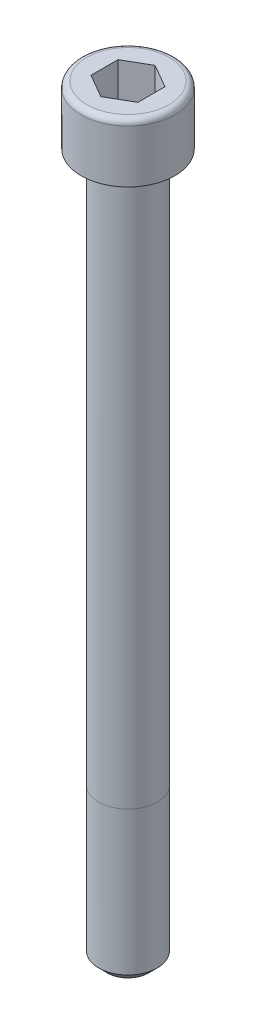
ISO-10303-21;
HEADER;
FILE_DESCRIPTION(('STEP AP214'),'2;1');
FILE_NAME('part.step','',(''),(''),'','','');
FILE_SCHEMA(('AUTOMOTIVE_DESIGN { 1 0 10303 214 1 1 1 1 }'));
ENDSEC;
DATA;
#1=APPLICATION_CONTEXT('core data for automotive mechanical design processes');
#2=APPLICATION_PROTOCOL_DEFINITION('international standard','automotive_design',2000,#1);
#3=PRODUCT_CONTEXT('',#1,'mechanical');
#4=PRODUCT('Part','Part','',(#3));
#5=PRODUCT_RELATED_PRODUCT_CATEGORY('part','',(#4));
#6=PRODUCT_DEFINITION_FORMATION('','',#4);
#7=PRODUCT_DEFINITION_CONTEXT('part definition',#1,'design');
#8=PRODUCT_DEFINITION('design','',#6,#7);
#9=PRODUCT_DEFINITION_SHAPE('','',#8);
#10=(LENGTH_UNIT() NAMED_UNIT(*) SI_UNIT(.MILLI.,.METRE.));
#11=(NAMED_UNIT(*) PLANE_ANGLE_UNIT() SI_UNIT($,.RADIAN.));
#12=(NAMED_UNIT(*) SI_UNIT($,.STERADIAN.) SOLID_ANGLE_UNIT());
#13=UNCERTAINTY_MEASURE_WITH_UNIT(LENGTH_MEASURE(1.E-05),#10,'distance_accuracy_value','');
#14=(GEOMETRIC_REPRESENTATION_CONTEXT(3) GLOBAL_UNCERTAINTY_ASSIGNED_CONTEXT((#13)) GLOBAL_UNIT_ASSIGNED_CONTEXT((#10,
#11,#12)) REPRESENTATION_CONTEXT('',''));
#15=CARTESIAN_POINT('',(0.,0.,0.));
#16=DIRECTION('',(0.,0.,1.));
#17=DIRECTION('',(1.,0.,0.));
#18=AXIS2_PLACEMENT_3D('',#15,#16,#17);
#19=CARTESIAN_POINT('',(0.,65.1172922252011,0.));
#20=DIRECTION('',(0.,1.,0.));
#21=DIRECTION('',(-1.,0.,0.));
#22=AXIS2_PLACEMENT_3D('',#19,#20,#21);
#23=CYLINDRICAL_SURFACE('',#22,4.99999999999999);
#24=CARTESIAN_POINT('',(0.,-128.5,0.));
#25=DIRECTION('',(0.,1.,0.));
#26=DIRECTION('',(-1.,0.,0.));
#27=AXIS2_PLACEMENT_3D('',#24,#25,#26);
#28=CIRCLE('',#27,5.);
#29=CARTESIAN_POINT('',(-4.99999999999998,-128.5,0.));
#30=VERTEX_POINT('',#29);
#31=EDGE_CURVE('E569',#30,#30,#28,.T.);
#32=ORIENTED_EDGE('',*,*,#31,.T.);
#33=EDGE_LOOP('',(#32));
#34=FACE_BOUND('',#33,.T.);
#35=CARTESIAN_POINT('',(0.,-104.,0.));
#36=DIRECTION('',(0.,1.,0.));
#37=DIRECTION('',(0.,0.,1.));
#38=AXIS2_PLACEMENT_3D('',#35,#36,#37);
#39=CIRCLE('',#38,4.99999999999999);
#40=CARTESIAN_POINT('',(0.,-104.,4.99999999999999));
#41=VERTEX_POINT('',#40);
#42=EDGE_CURVE('E11',#41,#41,#39,.T.);
#43=ORIENTED_EDGE('',*,*,#42,.F.);
#44=EDGE_LOOP('',(#43));
#45=FACE_BOUND('',#44,.T.);
#46=ADVANCED_FACE('F450',(#34,#45),#23,.T.);
#47=CARTESIAN_POINT('',(3.50000000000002,-130.,0.));
#48=DIRECTION('',(0.,-1.,0.));
#49=DIRECTION('',(1.,0.,0.));
#50=AXIS2_PLACEMENT_3D('',#47,#48,#49);
#51=PLANE('',#50);
#52=CARTESIAN_POINT('',(0.,-130.,0.));
#53=DIRECTION('',(0.,1.,0.));
#54=DIRECTION('',(-1.,0.,0.));
#55=AXIS2_PLACEMENT_3D('',#52,#53,#54);
#56=CIRCLE('',#55,3.5);
#57=CARTESIAN_POINT('',(-3.49999999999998,-130.,0.));
#58=VERTEX_POINT('',#57);
#59=EDGE_CURVE('E459',#58,#58,#56,.T.);
#60=ORIENTED_EDGE('',*,*,#59,.F.);
#61=EDGE_LOOP('',(#60));
#62=FACE_BOUND('',#61,.T.);
#63=ADVANCED_FACE('F452',(#62),#51,.T.);
#64=CARTESIAN_POINT('',(0.,-130.,0.));
#65=DIRECTION('',(0.,1.,0.));
#66=DIRECTION('',(-1.,0.,0.));
#67=AXIS2_PLACEMENT_3D('',#64,#65,#66);
#68=CONICAL_SURFACE('',#67,3.5,0.785398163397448);
#69=ORIENTED_EDGE('',*,*,#31,.F.);
#70=EDGE_LOOP('',(#69));
#71=FACE_BOUND('',#70,.T.);
#72=ORIENTED_EDGE('',*,*,#59,.T.);
#73=EDGE_LOOP('',(#72));
#74=FACE_BOUND('',#73,.T.);
#75=ADVANCED_FACE('F574',(#71,#74),#68,.T.);
#76=ORIENTED_EDGE('',*,*,#42,.T.);
#77=EDGE_LOOP('',(#76));
#78=FACE_BOUND('',#77,.T.);
#79=CARTESIAN_POINT('',(0.,-9.99999999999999,0.));
#80=DIRECTION('',(0.,1.,0.));
#81=DIRECTION('',(-1.,0.,0.));
#82=AXIS2_PLACEMENT_3D('',#79,#80,#81);
#83=CIRCLE('',#82,4.99999999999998);
#84=CARTESIAN_POINT('',(-4.99999999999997,-9.99999999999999,0.));
#85=VERTEX_POINT('',#84);
#86=EDGE_CURVE('E566',#85,#85,#83,.T.);
#87=ORIENTED_EDGE('',*,*,#86,.F.);
#88=EDGE_LOOP('',(#87));
#89=FACE_BOUND('',#88,.T.);
#90=ADVANCED_FACE('F580',(#78,#89),#23,.T.);
#91=CARTESIAN_POINT('',(4.99999999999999,-10.,0.));
#92=DIRECTION('',(0.,1.,0.));
#93=DIRECTION('',(-1.,0.,0.));
#94=AXIS2_PLACEMENT_3D('',#91,#92,#93);
#95=PLANE('',#94);
#96=CARTESIAN_POINT('',(0.,-9.99999999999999,0.));
#97=DIRECTION('',(0.,1.,0.));
#98=DIRECTION('',(-1.,0.,0.));
#99=AXIS2_PLACEMENT_3D('',#96,#97,#98);
#100=CIRCLE('',#99,7.99999999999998);
#101=CARTESIAN_POINT('',(-7.99999999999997,-10.,0.));
#102=VERTEX_POINT('',#101);
#103=EDGE_CURVE('E563',#102,#102,#100,.T.);
#104=ORIENTED_EDGE('',*,*,#103,.F.);
#105=EDGE_LOOP('',(#104));
#106=FACE_BOUND('',#105,.T.);
#107=ORIENTED_EDGE('',*,*,#86,.T.);
#108=EDGE_LOOP('',(#107));
#109=FACE_BOUND('',#108,.T.);
#110=ADVANCED_FACE('F591',(#106,#109),#95,.F.);
#111=CARTESIAN_POINT('',(0.,65.1172922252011,0.));
#112=DIRECTION('',(0.,1.,0.));
#113=DIRECTION('',(-1.,0.,0.));
#114=AXIS2_PLACEMENT_3D('',#111,#112,#113);
#115=CYLINDRICAL_SURFACE('',#114,7.99999999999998);
#116=CARTESIAN_POINT('',(0.,-1.,0.));
#117=DIRECTION('',(0.,1.,0.));
#118=DIRECTION('',(-1.,0.,0.));
#119=AXIS2_PLACEMENT_3D('',#116,#117,#118);
#120=CIRCLE('',#119,7.99999999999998);
#121=CARTESIAN_POINT('',(-7.99999999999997,-1.,0.));
#122=VERTEX_POINT('',#121);
#123=EDGE_CURVE('E560',#122,#122,#120,.T.);
#124=ORIENTED_EDGE('',*,*,#123,.F.);
#125=EDGE_LOOP('',(#124));
#126=FACE_BOUND('',#125,.T.);
#127=ORIENTED_EDGE('',*,*,#103,.T.);
#128=EDGE_LOOP('',(#127));
#129=FACE_BOUND('',#128,.T.);
#130=ADVANCED_FACE('F596',(#126,#129),#115,.T.);
#131=CARTESIAN_POINT('',(0.,-1.,0.));
#132=DIRECTION('',(0.,1.,0.));
#133=DIRECTION('',(-1.,0.,0.));
#134=AXIS2_PLACEMENT_3D('',#131,#132,#133);
#135=TOROIDAL_SURFACE('',#134,6.99999999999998,1.);
#136=CARTESIAN_POINT('',(0.,0.,0.));
#137=DIRECTION('',(0.,1.,0.));
#138=DIRECTION('',(-1.,0.,0.));
#139=AXIS2_PLACEMENT_3D('',#136,#137,#138);
#140=CIRCLE('',#139,6.99999999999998);
#141=CARTESIAN_POINT('',(-6.99999999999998,0.,0.));
#142=VERTEX_POINT('',#141);
#143=EDGE_CURVE('E551',#142,#142,#140,.T.);
#144=ORIENTED_EDGE('',*,*,#143,.F.);
#145=EDGE_LOOP('',(#144));
#146=FACE_BOUND('',#145,.T.);
#147=ORIENTED_EDGE('',*,*,#123,.T.);
#148=EDGE_LOOP('',(#147));
#149=FACE_BOUND('',#148,.T.);
#150=ADVANCED_FACE('F605',(#146,#149),#135,.T.);
#151=CARTESIAN_POINT('',(6.99999999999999,0.,0.));
#152=DIRECTION('',(0.,-1.,0.));
#153=DIRECTION('',(1.,0.,0.));
#154=AXIS2_PLACEMENT_3D('',#151,#152,#153);
#155=PLANE('',#154);
#156=DIRECTION('',(0.,0.,1.));
#157=VECTOR('',#156,1.);
#158=CARTESIAN_POINT('',(-4.,0.,-2.3094010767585));
#159=LINE('',#158,#157);
#160=CARTESIAN_POINT('',(-4.,0.,-2.3094010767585));
#161=VERTEX_POINT('',#160);
#162=CARTESIAN_POINT('',(-4.,0.,2.3094010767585));
#163=VERTEX_POINT('',#162);
#164=EDGE_CURVE('E520',#161,#163,#159,.T.);
#165=ORIENTED_EDGE('',*,*,#164,.F.);
#166=DIRECTION('',(-0.866025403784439,0.,0.5));
#167=VECTOR('',#166,1.);
#168=CARTESIAN_POINT('',(0.,0.,-4.61880215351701));
#169=LINE('',#168,#167);
#170=CARTESIAN_POINT('',(0.,0.,-4.61880215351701));
#171=VERTEX_POINT('',#170);
#172=EDGE_CURVE('E466',#171,#161,#169,.T.);
#173=ORIENTED_EDGE('',*,*,#172,.F.);
#174=DIRECTION('',(0.866025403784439,0.,0.5));
#175=VECTOR('',#174,1.);
#176=CARTESIAN_POINT('',(0.,0.,-4.61880215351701));
#177=LINE('',#176,#175);
#178=CARTESIAN_POINT('',(4.,0.,-2.3094010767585));
#179=VERTEX_POINT('',#178);
#180=EDGE_CURVE('E535',#171,#179,#177,.T.);
#181=ORIENTED_EDGE('',*,*,#180,.T.);
#182=DIRECTION('',(0.,0.,1.));
#183=VECTOR('',#182,1.);
#184=CARTESIAN_POINT('',(4.,0.,-2.3094010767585));
#185=LINE('',#184,#183);
#186=CARTESIAN_POINT('',(4.,0.,2.3094010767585));
#187=VERTEX_POINT('',#186);
#188=EDGE_CURVE('E530',#179,#187,#185,.T.);
#189=ORIENTED_EDGE('',*,*,#188,.T.);
#190=DIRECTION('',(-0.866025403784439,0.,0.5));
#191=VECTOR('',#190,1.);
#192=CARTESIAN_POINT('',(4.,0.,2.3094010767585));
#193=LINE('',#192,#191);
#194=CARTESIAN_POINT('',(0.,0.,4.61880215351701));
#195=VERTEX_POINT('',#194);
#196=EDGE_CURVE('E528',#187,#195,#193,.T.);
#197=ORIENTED_EDGE('',*,*,#196,.T.);
#198=DIRECTION('',(0.866025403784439,0.,0.5));
#199=VECTOR('',#198,1.);
#200=CARTESIAN_POINT('',(-4.,0.,2.3094010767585));
#201=LINE('',#200,#199);
#202=EDGE_CURVE('E509',#163,#195,#201,.T.);
#203=ORIENTED_EDGE('',*,*,#202,.F.);
#204=EDGE_LOOP('',(#165,#173,#181,#189,#197,#203));
#205=FACE_BOUND('',#204,.T.);
#206=ORIENTED_EDGE('',*,*,#143,.T.);
#207=EDGE_LOOP('',(#206));
#208=FACE_BOUND('',#207,.T.);
#209=ADVANCED_FACE('F524',(#205,#208),#155,.F.);
#210=CARTESIAN_POINT('',(0.,-7.2,-4.61880215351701));
#211=DIRECTION('',(-0.5,0.,-0.866025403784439));
#212=DIRECTION('',(-0.866025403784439,0.,0.5));
#213=AXIS2_PLACEMENT_3D('',#210,#211,#212);
#214=PLANE('',#213);
#215=ORIENTED_EDGE('',*,*,#172,.T.);
#216=DIRECTION('',(0.,1.,0.));
#217=VECTOR('',#216,1.);
#218=CARTESIAN_POINT('',(-4.,-7.2,-2.3094010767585));
#219=LINE('',#218,#217);
#220=CARTESIAN_POINT('',(-4.,-7.2,-2.3094010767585));
#221=VERTEX_POINT('',#220);
#222=EDGE_CURVE('E517',#221,#161,#219,.T.);
#223=ORIENTED_EDGE('',*,*,#222,.F.);
#224=DIRECTION('',(-0.866025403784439,0.,0.5));
#225=VECTOR('',#224,1.);
#226=CARTESIAN_POINT('',(0.,-7.2,-4.61880215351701));
#227=LINE('',#226,#225);
#228=CARTESIAN_POINT('',(0.,-7.2,-4.61880215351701));
#229=VERTEX_POINT('',#228);
#230=EDGE_CURVE('E538',#229,#221,#227,.T.);
#231=ORIENTED_EDGE('',*,*,#230,.F.);
#232=DIRECTION('',(0.,1.,0.));
#233=VECTOR('',#232,1.);
#234=CARTESIAN_POINT('',(0.,-7.2,-4.61880215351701));
#235=LINE('',#234,#233);
#236=EDGE_CURVE('E473',#229,#171,#235,.T.);
#237=ORIENTED_EDGE('',*,*,#236,.T.);
#238=EDGE_LOOP('',(#215,#223,#231,#237));
#239=FACE_BOUND('',#238,.T.);
#240=ADVANCED_FACE('F615',(#239),#214,.F.);
#241=CARTESIAN_POINT('',(0.,-7.2,-4.61880215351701));
#242=DIRECTION('',(-0.5,0.,0.866025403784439));
#243=DIRECTION('',(0.866025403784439,0.,0.5));
#244=AXIS2_PLACEMENT_3D('',#241,#242,#243);
#245=PLANE('',#244);
#246=ORIENTED_EDGE('',*,*,#180,.F.);
#247=ORIENTED_EDGE('',*,*,#236,.F.);
#248=DIRECTION('',(0.866025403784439,0.,0.5));
#249=VECTOR('',#248,1.);
#250=CARTESIAN_POINT('',(0.,-7.2,-4.61880215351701));
#251=LINE('',#250,#249);
#252=CARTESIAN_POINT('',(4.,-7.2,-2.3094010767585));
#253=VERTEX_POINT('',#252);
#254=EDGE_CURVE('E548',#229,#253,#251,.T.);
#255=ORIENTED_EDGE('',*,*,#254,.T.);
#256=DIRECTION('',(0.,1.,0.));
#257=VECTOR('',#256,1.);
#258=CARTESIAN_POINT('',(4.,-7.2,-2.3094010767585));
#259=LINE('',#258,#257);
#260=EDGE_CURVE('E552',#253,#179,#259,.T.);
#261=ORIENTED_EDGE('',*,*,#260,.T.);
#262=EDGE_LOOP('',(#246,#247,#255,#261));
#263=FACE_BOUND('',#262,.T.);
#264=ADVANCED_FACE('F618',(#263),#245,.T.);
#265=CARTESIAN_POINT('',(4.,-7.2,-2.3094010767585));
#266=DIRECTION('',(-1.,0.,0.));
#267=DIRECTION('',(0.,-1.,0.));
#268=AXIS2_PLACEMENT_3D('',#265,#266,#267);
#269=PLANE('',#268);
#270=ORIENTED_EDGE('',*,*,#188,.F.);
#271=ORIENTED_EDGE('',*,*,#260,.F.);
#272=DIRECTION('',(0.,0.,1.));
#273=VECTOR('',#272,1.);
#274=CARTESIAN_POINT('',(4.,-7.2,-2.3094010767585));
#275=LINE('',#274,#273);
#276=CARTESIAN_POINT('',(4.,-7.2,2.3094010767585));
#277=VERTEX_POINT('',#276);
#278=EDGE_CURVE('E546',#253,#277,#275,.T.);
#279=ORIENTED_EDGE('',*,*,#278,.T.);
#280=DIRECTION('',(0.,1.,0.));
#281=VECTOR('',#280,1.);
#282=CARTESIAN_POINT('',(4.,-7.2,2.3094010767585));
#283=LINE('',#282,#281);
#284=EDGE_CURVE('E554',#277,#187,#283,.T.);
#285=ORIENTED_EDGE('',*,*,#284,.T.);
#286=EDGE_LOOP('',(#270,#271,#279,#285));
#287=FACE_BOUND('',#286,.T.);
#288=ADVANCED_FACE('F627',(#287),#269,.T.);
#289=CARTESIAN_POINT('',(4.,-7.2,2.3094010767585));
#290=DIRECTION('',(-0.5,0.,-0.866025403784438));
#291=DIRECTION('',(-0.866025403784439,0.,0.5));
#292=AXIS2_PLACEMENT_3D('',#289,#290,#291);
#293=PLANE('',#292);
#294=ORIENTED_EDGE('',*,*,#196,.F.);
#295=ORIENTED_EDGE('',*,*,#284,.F.);
#296=DIRECTION('',(-0.866025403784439,0.,0.5));
#297=VECTOR('',#296,1.);
#298=CARTESIAN_POINT('',(4.,-7.2,2.3094010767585));
#299=LINE('',#298,#297);
#300=CARTESIAN_POINT('',(0.,-7.2,4.61880215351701));
#301=VERTEX_POINT('',#300);
#302=EDGE_CURVE('E544',#277,#301,#299,.T.);
#303=ORIENTED_EDGE('',*,*,#302,.T.);
#304=DIRECTION('',(0.,1.,0.));
#305=VECTOR('',#304,1.);
#306=CARTESIAN_POINT('',(0.,-7.2,4.61880215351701));
#307=LINE('',#306,#305);
#308=EDGE_CURVE('E516',#301,#195,#307,.T.);
#309=ORIENTED_EDGE('',*,*,#308,.T.);
#310=EDGE_LOOP('',(#294,#295,#303,#309));
#311=FACE_BOUND('',#310,.T.);
#312=ADVANCED_FACE('F624',(#311),#293,.T.);
#313=CARTESIAN_POINT('',(-4.,-7.2,2.3094010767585));
#314=DIRECTION('',(-0.5,0.,0.866025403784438));
#315=DIRECTION('',(0.866025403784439,0.,0.5));
#316=AXIS2_PLACEMENT_3D('',#313,#314,#315);
#317=PLANE('',#316);
#318=ORIENTED_EDGE('',*,*,#202,.T.);
#319=ORIENTED_EDGE('',*,*,#308,.F.);
#320=DIRECTION('',(0.866025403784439,0.,0.5));
#321=VECTOR('',#320,1.);
#322=CARTESIAN_POINT('',(-4.,-7.2,2.3094010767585));
#323=LINE('',#322,#321);
#324=CARTESIAN_POINT('',(-4.,-7.2,2.3094010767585));
#325=VERTEX_POINT('',#324);
#326=EDGE_CURVE('E512',#325,#301,#323,.T.);
#327=ORIENTED_EDGE('',*,*,#326,.F.);
#328=DIRECTION('',(0.,1.,0.));
#329=VECTOR('',#328,1.);
#330=CARTESIAN_POINT('',(-4.,-7.2,2.3094010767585));
#331=LINE('',#330,#329);
#332=EDGE_CURVE('E504',#325,#163,#331,.T.);
#333=ORIENTED_EDGE('',*,*,#332,.T.);
#334=EDGE_LOOP('',(#318,#319,#327,#333));
#335=FACE_BOUND('',#334,.T.);
#336=ADVANCED_FACE('F506',(#335),#317,.F.);
#337=CARTESIAN_POINT('',(-4.,-7.2,-2.3094010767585));
#338=DIRECTION('',(-1.,0.,0.));
#339=DIRECTION('',(0.,-1.,0.));
#340=AXIS2_PLACEMENT_3D('',#337,#338,#339);
#341=PLANE('',#340);
#342=ORIENTED_EDGE('',*,*,#164,.T.);
#343=ORIENTED_EDGE('',*,*,#332,.F.);
#344=DIRECTION('',(0.,0.,1.));
#345=VECTOR('',#344,1.);
#346=CARTESIAN_POINT('',(-4.,-7.2,-2.3094010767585));
#347=LINE('',#346,#345);
#348=EDGE_CURVE('E541',#221,#325,#347,.T.);
#349=ORIENTED_EDGE('',*,*,#348,.F.);
#350=ORIENTED_EDGE('',*,*,#222,.T.);
#351=EDGE_LOOP('',(#342,#343,#349,#350));
#352=FACE_BOUND('',#351,.T.);
#353=ADVANCED_FACE('F521',(#352),#341,.F.);
#354=CARTESIAN_POINT('',(-4.,-7.2,-2.3094010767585));
#355=DIRECTION('',(0.,1.,0.));
#356=DIRECTION('',(-1.,0.,0.));
#357=AXIS2_PLACEMENT_3D('',#354,#355,#356);
#358=PLANE('',#357);
#359=ORIENTED_EDGE('',*,*,#230,.T.);
#360=ORIENTED_EDGE('',*,*,#348,.T.);
#361=ORIENTED_EDGE('',*,*,#326,.T.);
#362=ORIENTED_EDGE('',*,*,#302,.F.);
#363=ORIENTED_EDGE('',*,*,#278,.F.);
#364=ORIENTED_EDGE('',*,*,#254,.F.);
#365=EDGE_LOOP('',(#359,#360,#361,#362,#363,#364));
#366=FACE_BOUND('',#365,.T.);
#367=ADVANCED_FACE('F621',(#366),#358,.T.);
#368=CLOSED_SHELL('',(#46,#63,#75,#90,#110,#130,#150,#209,#240,#264,#288,#312,#336,#353,#367));
#369=MANIFOLD_SOLID_BREP('B2',#368);
#370=ADVANCED_BREP_SHAPE_REPRESENTATION('',(#18,#369),#14);
#371=SHAPE_DEFINITION_REPRESENTATION(#9,#370);
ENDSEC;
END-ISO-10303-21;
